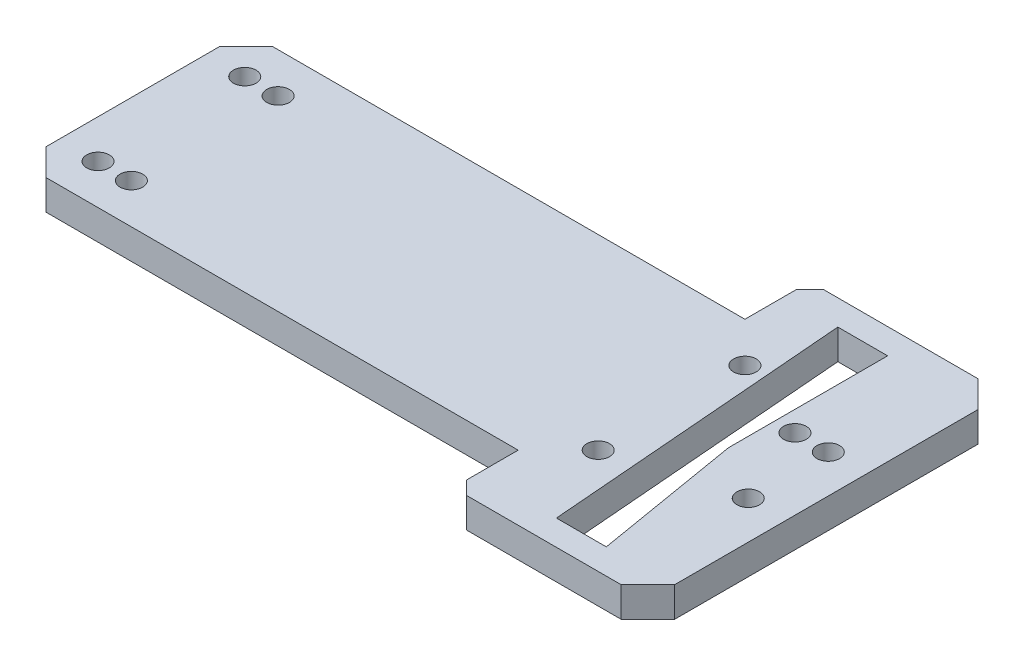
ISO-10303-21;
HEADER;
FILE_DESCRIPTION(('STEP AP214'),'2;1');
FILE_NAME('part.step','',(''),(''),'','','');
FILE_SCHEMA(('AUTOMOTIVE_DESIGN { 1 0 10303 214 1 1 1 1 }'));
ENDSEC;
DATA;
#1=APPLICATION_CONTEXT('core data for automotive mechanical design processes');
#2=APPLICATION_PROTOCOL_DEFINITION('international standard','automotive_design',2000,#1);
#3=PRODUCT_CONTEXT('',#1,'mechanical');
#4=PRODUCT('Part','Part','',(#3));
#5=PRODUCT_RELATED_PRODUCT_CATEGORY('part','',(#4));
#6=PRODUCT_DEFINITION_FORMATION('','',#4);
#7=PRODUCT_DEFINITION_CONTEXT('part definition',#1,'design');
#8=PRODUCT_DEFINITION('design','',#6,#7);
#9=PRODUCT_DEFINITION_SHAPE('','',#8);
#10=(LENGTH_UNIT() NAMED_UNIT(*) SI_UNIT(.MILLI.,.METRE.));
#11=(NAMED_UNIT(*) PLANE_ANGLE_UNIT() SI_UNIT($,.RADIAN.));
#12=(NAMED_UNIT(*) SI_UNIT($,.STERADIAN.) SOLID_ANGLE_UNIT());
#13=UNCERTAINTY_MEASURE_WITH_UNIT(LENGTH_MEASURE(1.E-05),#10,'distance_accuracy_value','');
#14=(GEOMETRIC_REPRESENTATION_CONTEXT(3) GLOBAL_UNCERTAINTY_ASSIGNED_CONTEXT((#13)) GLOBAL_UNIT_ASSIGNED_CONTEXT((#10,
#11,#12)) REPRESENTATION_CONTEXT('',''));
#15=CARTESIAN_POINT('',(0.,0.,0.));
#16=DIRECTION('',(0.,0.,1.));
#17=DIRECTION('',(1.,0.,0.));
#18=AXIS2_PLACEMENT_3D('',#15,#16,#17);
#19=CARTESIAN_POINT('',(0.,4.5,0.));
#20=DIRECTION('',(0.,1.,0.));
#21=DIRECTION('',(0.,0.,1.));
#22=AXIS2_PLACEMENT_3D('',#19,#20,#21);
#23=PLANE('',#22);
#24=CARTESIAN_POINT('',(51.3,4.5,-6.00000000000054));
#25=DIRECTION('',(0.,1.,0.));
#26=DIRECTION('',(0.,0.,1.));
#27=AXIS2_PLACEMENT_3D('',#24,#25,#26);
#28=CIRCLE('',#27,1.7);
#29=CARTESIAN_POINT('',(51.3,4.5,-4.30000000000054));
#30=VERTEX_POINT('',#29);
#31=EDGE_CURVE('E652',#30,#30,#28,.T.);
#32=ORIENTED_EDGE('',*,*,#31,.F.);
#33=EDGE_LOOP('',(#32));
#34=FACE_BOUND('',#33,.T.);
#35=CARTESIAN_POINT('',(33.8,4.5,10.9999999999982));
#36=DIRECTION('',(0.,1.,0.));
#37=DIRECTION('',(0.,0.,1.));
#38=AXIS2_PLACEMENT_3D('',#35,#36,#37);
#39=CIRCLE('',#38,1.7);
#40=CARTESIAN_POINT('',(33.8,4.5,12.6999999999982));
#41=VERTEX_POINT('',#40);
#42=EDGE_CURVE('E664',#41,#41,#39,.T.);
#43=ORIENTED_EDGE('',*,*,#42,.F.);
#44=EDGE_LOOP('',(#43));
#45=FACE_BOUND('',#44,.T.);
#46=CARTESIAN_POINT('',(-36.2,4.5,10.9999999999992));
#47=DIRECTION('',(0.,1.,0.));
#48=DIRECTION('',(0.,0.,1.));
#49=AXIS2_PLACEMENT_3D('',#46,#47,#48);
#50=CIRCLE('',#49,1.7);
#51=CARTESIAN_POINT('',(-36.2,4.5,12.6999999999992));
#52=VERTEX_POINT('',#51);
#53=EDGE_CURVE('E676',#52,#52,#50,.T.);
#54=ORIENTED_EDGE('',*,*,#53,.F.);
#55=EDGE_LOOP('',(#54));
#56=FACE_BOUND('',#55,.T.);
#57=CARTESIAN_POINT('',(-41.2,4.5,10.9999999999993));
#58=DIRECTION('',(0.,1.,0.));
#59=DIRECTION('',(0.,0.,1.));
#60=AXIS2_PLACEMENT_3D('',#57,#58,#59);
#61=CIRCLE('',#60,1.7);
#62=CARTESIAN_POINT('',(-41.2,4.5,12.6999999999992));
#63=VERTEX_POINT('',#62);
#64=EDGE_CURVE('E688',#63,#63,#61,.T.);
#65=ORIENTED_EDGE('',*,*,#64,.F.);
#66=EDGE_LOOP('',(#65));
#67=FACE_BOUND('',#66,.T.);
#68=DIRECTION('',(-0.166195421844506,0.,-0.986092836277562));
#69=VECTOR('',#68,1.);
#70=CARTESIAN_POINT('',(43.25,4.5,0.912138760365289));
#71=LINE('',#70,#69);
#72=CARTESIAN_POINT('',(46.9642462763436,4.5,22.9500000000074));
#73=VERTEX_POINT('',#72);
#74=CARTESIAN_POINT('',(43.25,4.5,0.912138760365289));
#75=VERTEX_POINT('',#74);
#76=EDGE_CURVE('E172',#73,#75,#71,.T.);
#77=ORIENTED_EDGE('',*,*,#76,.F.);
#78=DIRECTION('',(1.,0.,0.));
#79=VECTOR('',#78,1.);
#80=CARTESIAN_POINT('',(46.9642462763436,4.5,22.9500000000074));
#81=LINE('',#80,#79);
#82=CARTESIAN_POINT('',(39.4842462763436,4.5,22.9500000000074));
#83=VERTEX_POINT('',#82);
#84=EDGE_CURVE('E164',#83,#73,#81,.T.);
#85=ORIENTED_EDGE('',*,*,#84,.F.);
#86=DIRECTION('',(0.0803714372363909,0.,0.996764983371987));
#87=VECTOR('',#86,1.);
#88=CARTESIAN_POINT('',(39.4842462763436,4.5,22.9500000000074));
#89=LINE('',#88,#87);
#90=CARTESIAN_POINT('',(35.7832244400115,4.5,-22.95));
#91=VERTEX_POINT('',#90);
#92=EDGE_CURVE('E193',#91,#83,#89,.T.);
#93=ORIENTED_EDGE('',*,*,#92,.F.);
#94=DIRECTION('',(-1.,0.,0.));
#95=VECTOR('',#94,1.);
#96=CARTESIAN_POINT('',(35.7832244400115,4.5,-22.95));
#97=LINE('',#96,#95);
#98=CARTESIAN_POINT('',(43.25,4.5,-22.95));
#99=VERTEX_POINT('',#98);
#100=EDGE_CURVE('E188',#99,#91,#97,.T.);
#101=ORIENTED_EDGE('',*,*,#100,.F.);
#102=DIRECTION('',(0.,0.,-1.));
#103=VECTOR('',#102,1.);
#104=CARTESIAN_POINT('',(43.25,4.5,-22.95));
#105=LINE('',#104,#103);
#106=EDGE_CURVE('E186',#75,#99,#105,.T.);
#107=ORIENTED_EDGE('',*,*,#106,.F.);
#108=EDGE_LOOP('',(#77,#85,#93,#101,#107));
#109=FACE_BOUND('',#108,.T.);
#110=DIRECTION('',(0.,0.,1.));
#111=VECTOR('',#110,1.);
#112=CARTESIAN_POINT('',(27.8,4.5,-16.9999999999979));
#113=LINE('',#112,#111);
#114=CARTESIAN_POINT('',(27.8,4.5,-24.7500000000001));
#115=VERTEX_POINT('',#114);
#116=CARTESIAN_POINT('',(27.8,4.5,-16.9999999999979));
#117=VERTEX_POINT('',#116);
#118=EDGE_CURVE('E211',#115,#117,#113,.T.);
#119=ORIENTED_EDGE('',*,*,#118,.T.);
#120=DIRECTION('',(-1.,0.,0.));
#121=VECTOR('',#120,1.);
#122=CARTESIAN_POINT('',(-43.0000000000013,4.5,-16.9999999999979));
#123=LINE('',#122,#121);
#124=CARTESIAN_POINT('',(-43.0000000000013,4.5,-16.9999999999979));
#125=VERTEX_POINT('',#124);
#126=EDGE_CURVE('E214',#117,#125,#123,.T.);
#127=ORIENTED_EDGE('',*,*,#126,.T.);
#128=DIRECTION('',(-0.707106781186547,0.,0.707106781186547));
#129=VECTOR('',#128,1.);
#130=CARTESIAN_POINT('',(-47.000000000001,4.5,-12.9999999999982));
#131=LINE('',#130,#129);
#132=CARTESIAN_POINT('',(-47.000000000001,4.5,-12.9999999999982));
#133=VERTEX_POINT('',#132);
#134=EDGE_CURVE('E217',#125,#133,#131,.T.);
#135=ORIENTED_EDGE('',*,*,#134,.T.);
#136=DIRECTION('',(0.,0.,1.));
#137=VECTOR('',#136,1.);
#138=CARTESIAN_POINT('',(-47.000000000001,4.5,-12.9999999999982));
#139=LINE('',#138,#137);
#140=CARTESIAN_POINT('',(-47.000000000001,4.5,12.9999999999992));
#141=VERTEX_POINT('',#140);
#142=EDGE_CURVE('E219',#133,#141,#139,.T.);
#143=ORIENTED_EDGE('',*,*,#142,.T.);
#144=DIRECTION('',(0.707106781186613,0.,0.707106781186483));
#145=VECTOR('',#144,1.);
#146=CARTESIAN_POINT('',(-47.000000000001,4.5,12.9999999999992));
#147=LINE('',#146,#145);
#148=CARTESIAN_POINT('',(-43.0000000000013,4.5,16.9999999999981));
#149=VERTEX_POINT('',#148);
#150=EDGE_CURVE('E221',#141,#149,#147,.T.);
#151=ORIENTED_EDGE('',*,*,#150,.T.);
#152=DIRECTION('',(1.,0.,0.));
#153=VECTOR('',#152,1.);
#154=CARTESIAN_POINT('',(-43.0000000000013,4.5,16.9999999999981));
#155=LINE('',#154,#153);
#156=CARTESIAN_POINT('',(27.7999999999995,4.5,16.9999999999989));
#157=VERTEX_POINT('',#156);
#158=EDGE_CURVE('E223',#149,#157,#155,.T.);
#159=ORIENTED_EDGE('',*,*,#158,.T.);
#160=DIRECTION('',(0.,0.,1.));
#161=VECTOR('',#160,1.);
#162=CARTESIAN_POINT('',(27.7999999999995,4.5,16.9999999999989));
#163=LINE('',#162,#161);
#164=CARTESIAN_POINT('',(27.7999999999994,4.5,24.7499999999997));
#165=VERTEX_POINT('',#164);
#166=EDGE_CURVE('E225',#157,#165,#163,.T.);
#167=ORIENTED_EDGE('',*,*,#166,.T.);
#168=DIRECTION('',(0.707106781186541,0.,0.707106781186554));
#169=VECTOR('',#168,1.);
#170=CARTESIAN_POINT('',(27.7999999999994,4.5,24.7499999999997));
#171=LINE('',#170,#169);
#172=CARTESIAN_POINT('',(29.7999999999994,4.5,26.7499999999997));
#173=VERTEX_POINT('',#172);
#174=EDGE_CURVE('E227',#165,#173,#171,.T.);
#175=ORIENTED_EDGE('',*,*,#174,.T.);
#176=DIRECTION('',(1.,0.,0.));
#177=VECTOR('',#176,1.);
#178=CARTESIAN_POINT('',(52.9999999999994,4.5,26.7499999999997));
#179=LINE('',#178,#177);
#180=CARTESIAN_POINT('',(52.9999999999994,4.5,26.7499999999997));
#181=VERTEX_POINT('',#180);
#182=EDGE_CURVE('E229',#173,#181,#179,.T.);
#183=ORIENTED_EDGE('',*,*,#182,.T.);
#184=DIRECTION('',(0.707106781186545,0.,-0.70710678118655));
#185=VECTOR('',#184,1.);
#186=CARTESIAN_POINT('',(52.9999999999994,4.5,26.7499999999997));
#187=LINE('',#186,#185);
#188=CARTESIAN_POINT('',(56.9999999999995,4.5,22.7499999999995));
#189=VERTEX_POINT('',#188);
#190=EDGE_CURVE('E231',#181,#189,#187,.T.);
#191=ORIENTED_EDGE('',*,*,#190,.T.);
#192=DIRECTION('',(0.,0.,-1.));
#193=VECTOR('',#192,1.);
#194=CARTESIAN_POINT('',(56.9999999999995,4.5,22.7499999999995));
#195=LINE('',#194,#193);
#196=CARTESIAN_POINT('',(56.9999999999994,4.5,-22.7500000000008));
#197=VERTEX_POINT('',#196);
#198=EDGE_CURVE('E233',#189,#197,#195,.T.);
#199=ORIENTED_EDGE('',*,*,#198,.T.);
#200=DIRECTION('',(-0.707106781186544,0.,-0.707106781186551));
#201=VECTOR('',#200,1.);
#202=CARTESIAN_POINT('',(56.9999999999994,4.5,-22.7500000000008));
#203=LINE('',#202,#201);
#204=CARTESIAN_POINT('',(52.9999999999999,4.5,-26.7500000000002));
#205=VERTEX_POINT('',#204);
#206=EDGE_CURVE('E235',#197,#205,#203,.T.);
#207=ORIENTED_EDGE('',*,*,#206,.T.);
#208=DIRECTION('',(-1.,0.,0.));
#209=VECTOR('',#208,1.);
#210=CARTESIAN_POINT('',(52.9999999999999,4.5,-26.7500000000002));
#211=LINE('',#210,#209);
#212=CARTESIAN_POINT('',(29.8,4.5,-26.7500000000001));
#213=VERTEX_POINT('',#212);
#214=EDGE_CURVE('E237',#205,#213,#211,.T.);
#215=ORIENTED_EDGE('',*,*,#214,.T.);
#216=DIRECTION('',(-0.707106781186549,0.,0.707106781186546));
#217=VECTOR('',#216,1.);
#218=CARTESIAN_POINT('',(27.8,4.5,-24.7500000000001));
#219=LINE('',#218,#217);
#220=EDGE_CURVE('E239',#213,#115,#219,.T.);
#221=ORIENTED_EDGE('',*,*,#220,.T.);
#222=EDGE_LOOP('',(#119,#127,#135,#143,#151,#159,#167,#175,#183,#191,#199,#207,#215,#221));
#223=FACE_BOUND('',#222,.T.);
#224=CARTESIAN_POINT('',(-41.2,4.5,-10.9999999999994));
#225=DIRECTION('',(0.,1.,0.));
#226=DIRECTION('',(0.,0.,1.));
#227=AXIS2_PLACEMENT_3D('',#224,#225,#226);
#228=CIRCLE('',#227,1.7);
#229=CARTESIAN_POINT('',(-41.2,4.5,-9.29999999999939));
#230=VERTEX_POINT('',#229);
#231=EDGE_CURVE('E196',#230,#230,#228,.T.);
#232=ORIENTED_EDGE('',*,*,#231,.F.);
#233=EDGE_LOOP('',(#232));
#234=FACE_BOUND('',#233,.T.);
#235=CARTESIAN_POINT('',(-36.2,4.5,-10.9999999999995));
#236=DIRECTION('',(0.,1.,0.));
#237=DIRECTION('',(0.,0.,1.));
#238=AXIS2_PLACEMENT_3D('',#235,#236,#237);
#239=CIRCLE('',#238,1.7);
#240=CARTESIAN_POINT('',(-36.2,4.5,-9.29999999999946));
#241=VERTEX_POINT('',#240);
#242=EDGE_CURVE('E682',#241,#241,#239,.T.);
#243=ORIENTED_EDGE('',*,*,#242,.F.);
#244=EDGE_LOOP('',(#243));
#245=FACE_BOUND('',#244,.T.);
#246=CARTESIAN_POINT('',(33.8,4.5,-10.9999999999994));
#247=DIRECTION('',(0.,1.,0.));
#248=DIRECTION('',(0.,0.,1.));
#249=AXIS2_PLACEMENT_3D('',#246,#247,#248);
#250=CIRCLE('',#249,1.70000000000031);
#251=CARTESIAN_POINT('',(33.8,4.5,-9.29999999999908));
#252=VERTEX_POINT('',#251);
#253=EDGE_CURVE('E670',#252,#252,#250,.T.);
#254=ORIENTED_EDGE('',*,*,#253,.F.);
#255=EDGE_LOOP('',(#254));
#256=FACE_BOUND('',#255,.T.);
#257=CARTESIAN_POINT('',(46.3,4.5,-6.00000000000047));
#258=DIRECTION('',(0.,1.,0.));
#259=DIRECTION('',(0.,0.,1.));
#260=AXIS2_PLACEMENT_3D('',#257,#258,#259);
#261=CIRCLE('',#260,1.7);
#262=CARTESIAN_POINT('',(46.3,4.5,-4.30000000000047));
#263=VERTEX_POINT('',#262);
#264=EDGE_CURVE('E658',#263,#263,#261,.T.);
#265=ORIENTED_EDGE('',*,*,#264,.F.);
#266=EDGE_LOOP('',(#265));
#267=FACE_BOUND('',#266,.T.);
#268=CARTESIAN_POINT('',(51.3,4.5,5.99999999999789));
#269=DIRECTION('',(0.,1.,0.));
#270=DIRECTION('',(0.,0.,1.));
#271=AXIS2_PLACEMENT_3D('',#268,#269,#270);
#272=CIRCLE('',#271,1.7);
#273=CARTESIAN_POINT('',(51.3,4.5,7.69999999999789));
#274=VERTEX_POINT('',#273);
#275=EDGE_CURVE('E643',#274,#274,#272,.T.);
#276=ORIENTED_EDGE('',*,*,#275,.F.);
#277=EDGE_LOOP('',(#276));
#278=FACE_BOUND('',#277,.T.);
#279=ADVANCED_FACE('F33',(#34,#45,#56,#67,#109,#223,#234,#245,#256,#267,#278),#23,.T.);
#280=CARTESIAN_POINT('',(0.,0.,0.));
#281=DIRECTION('',(0.,1.,0.));
#282=DIRECTION('',(0.,0.,1.));
#283=AXIS2_PLACEMENT_3D('',#280,#281,#282);
#284=PLANE('',#283);
#285=CARTESIAN_POINT('',(51.3,0.,-6.00000000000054));
#286=DIRECTION('',(0.,1.,0.));
#287=DIRECTION('',(0.,0.,1.));
#288=AXIS2_PLACEMENT_3D('',#285,#286,#287);
#289=CIRCLE('',#288,1.7);
#290=CARTESIAN_POINT('',(51.3,0.,-4.30000000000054));
#291=VERTEX_POINT('',#290);
#292=EDGE_CURVE('E649',#291,#291,#289,.T.);
#293=ORIENTED_EDGE('',*,*,#292,.T.);
#294=EDGE_LOOP('',(#293));
#295=FACE_BOUND('',#294,.T.);
#296=CARTESIAN_POINT('',(33.8,0.,10.9999999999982));
#297=DIRECTION('',(0.,1.,0.));
#298=DIRECTION('',(0.,0.,1.));
#299=AXIS2_PLACEMENT_3D('',#296,#297,#298);
#300=CIRCLE('',#299,1.7);
#301=CARTESIAN_POINT('',(33.8,0.,12.6999999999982));
#302=VERTEX_POINT('',#301);
#303=EDGE_CURVE('E661',#302,#302,#300,.T.);
#304=ORIENTED_EDGE('',*,*,#303,.T.);
#305=EDGE_LOOP('',(#304));
#306=FACE_BOUND('',#305,.T.);
#307=CARTESIAN_POINT('',(-36.2,0.,10.9999999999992));
#308=DIRECTION('',(0.,1.,0.));
#309=DIRECTION('',(0.,0.,1.));
#310=AXIS2_PLACEMENT_3D('',#307,#308,#309);
#311=CIRCLE('',#310,1.7);
#312=CARTESIAN_POINT('',(-36.2,0.,12.6999999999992));
#313=VERTEX_POINT('',#312);
#314=EDGE_CURVE('E673',#313,#313,#311,.T.);
#315=ORIENTED_EDGE('',*,*,#314,.T.);
#316=EDGE_LOOP('',(#315));
#317=FACE_BOUND('',#316,.T.);
#318=CARTESIAN_POINT('',(-41.2,0.,10.9999999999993));
#319=DIRECTION('',(0.,1.,0.));
#320=DIRECTION('',(0.,0.,1.));
#321=AXIS2_PLACEMENT_3D('',#318,#319,#320);
#322=CIRCLE('',#321,1.7);
#323=CARTESIAN_POINT('',(-41.2,0.,12.6999999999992));
#324=VERTEX_POINT('',#323);
#325=EDGE_CURVE('E685',#324,#324,#322,.T.);
#326=ORIENTED_EDGE('',*,*,#325,.T.);
#327=EDGE_LOOP('',(#326));
#328=FACE_BOUND('',#327,.T.);
#329=DIRECTION('',(1.,0.,0.));
#330=VECTOR('',#329,1.);
#331=CARTESIAN_POINT('',(46.9642462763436,0.,22.9500000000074));
#332=LINE('',#331,#330);
#333=CARTESIAN_POINT('',(39.4842462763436,0.,22.9500000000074));
#334=VERTEX_POINT('',#333);
#335=CARTESIAN_POINT('',(46.9642462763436,0.,22.9500000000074));
#336=VERTEX_POINT('',#335);
#337=EDGE_CURVE('E56',#334,#336,#332,.T.);
#338=ORIENTED_EDGE('',*,*,#337,.T.);
#339=DIRECTION('',(-0.166195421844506,0.,-0.986092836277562));
#340=VECTOR('',#339,1.);
#341=CARTESIAN_POINT('',(43.25,0.,0.912138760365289));
#342=LINE('',#341,#340);
#343=CARTESIAN_POINT('',(43.25,0.,0.912138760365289));
#344=VERTEX_POINT('',#343);
#345=EDGE_CURVE('E179',#336,#344,#342,.T.);
#346=ORIENTED_EDGE('',*,*,#345,.T.);
#347=DIRECTION('',(0.,0.,-1.));
#348=VECTOR('',#347,1.);
#349=CARTESIAN_POINT('',(43.25,0.,-22.95));
#350=LINE('',#349,#348);
#351=CARTESIAN_POINT('',(43.25,0.,-22.95));
#352=VERTEX_POINT('',#351);
#353=EDGE_CURVE('E198',#344,#352,#350,.T.);
#354=ORIENTED_EDGE('',*,*,#353,.T.);
#355=DIRECTION('',(-1.,0.,0.));
#356=VECTOR('',#355,1.);
#357=CARTESIAN_POINT('',(35.7832244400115,0.,-22.95));
#358=LINE('',#357,#356);
#359=CARTESIAN_POINT('',(35.7832244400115,0.,-22.95));
#360=VERTEX_POINT('',#359);
#361=EDGE_CURVE('E201',#352,#360,#358,.T.);
#362=ORIENTED_EDGE('',*,*,#361,.T.);
#363=DIRECTION('',(0.0803714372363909,0.,0.996764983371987));
#364=VECTOR('',#363,1.);
#365=CARTESIAN_POINT('',(39.4842462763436,0.,22.9500000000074));
#366=LINE('',#365,#364);
#367=EDGE_CURVE('E173',#360,#334,#366,.T.);
#368=ORIENTED_EDGE('',*,*,#367,.T.);
#369=EDGE_LOOP('',(#338,#346,#354,#362,#368));
#370=FACE_BOUND('',#369,.T.);
#371=DIRECTION('',(0.,0.,1.));
#372=VECTOR('',#371,1.);
#373=CARTESIAN_POINT('',(27.8,0.,-16.9999999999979));
#374=LINE('',#373,#372);
#375=CARTESIAN_POINT('',(27.8,0.,-24.7500000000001));
#376=VERTEX_POINT('',#375);
#377=CARTESIAN_POINT('',(27.8,0.,-16.9999999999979));
#378=VERTEX_POINT('',#377);
#379=EDGE_CURVE('E180',#376,#378,#374,.T.);
#380=ORIENTED_EDGE('',*,*,#379,.F.);
#381=DIRECTION('',(-0.707106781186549,0.,0.707106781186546));
#382=VECTOR('',#381,1.);
#383=CARTESIAN_POINT('',(27.8,0.,-24.7500000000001));
#384=LINE('',#383,#382);
#385=CARTESIAN_POINT('',(29.8,0.,-26.7500000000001));
#386=VERTEX_POINT('',#385);
#387=EDGE_CURVE('E215',#386,#376,#384,.T.);
#388=ORIENTED_EDGE('',*,*,#387,.F.);
#389=DIRECTION('',(-1.,0.,0.));
#390=VECTOR('',#389,1.);
#391=CARTESIAN_POINT('',(52.9999999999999,0.,-26.7500000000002));
#392=LINE('',#391,#390);
#393=CARTESIAN_POINT('',(52.9999999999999,0.,-26.7500000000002));
#394=VERTEX_POINT('',#393);
#395=EDGE_CURVE('E266',#394,#386,#392,.T.);
#396=ORIENTED_EDGE('',*,*,#395,.F.);
#397=DIRECTION('',(-0.707106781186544,0.,-0.707106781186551));
#398=VECTOR('',#397,1.);
#399=CARTESIAN_POINT('',(56.9999999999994,0.,-22.7500000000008));
#400=LINE('',#399,#398);
#401=CARTESIAN_POINT('',(56.9999999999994,0.,-22.7500000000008));
#402=VERTEX_POINT('',#401);
#403=EDGE_CURVE('E264',#402,#394,#400,.T.);
#404=ORIENTED_EDGE('',*,*,#403,.F.);
#405=DIRECTION('',(0.,0.,-1.));
#406=VECTOR('',#405,1.);
#407=CARTESIAN_POINT('',(56.9999999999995,0.,22.7499999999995));
#408=LINE('',#407,#406);
#409=CARTESIAN_POINT('',(56.9999999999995,0.,22.7499999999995));
#410=VERTEX_POINT('',#409);
#411=EDGE_CURVE('E262',#410,#402,#408,.T.);
#412=ORIENTED_EDGE('',*,*,#411,.F.);
#413=DIRECTION('',(0.707106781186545,0.,-0.70710678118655));
#414=VECTOR('',#413,1.);
#415=CARTESIAN_POINT('',(52.9999999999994,0.,26.7499999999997));
#416=LINE('',#415,#414);
#417=CARTESIAN_POINT('',(52.9999999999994,0.,26.7499999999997));
#418=VERTEX_POINT('',#417);
#419=EDGE_CURVE('E260',#418,#410,#416,.T.);
#420=ORIENTED_EDGE('',*,*,#419,.F.);
#421=DIRECTION('',(1.,0.,0.));
#422=VECTOR('',#421,1.);
#423=CARTESIAN_POINT('',(52.9999999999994,0.,26.7499999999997));
#424=LINE('',#423,#422);
#425=CARTESIAN_POINT('',(29.7999999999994,0.,26.7499999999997));
#426=VERTEX_POINT('',#425);
#427=EDGE_CURVE('E258',#426,#418,#424,.T.);
#428=ORIENTED_EDGE('',*,*,#427,.F.);
#429=DIRECTION('',(0.707106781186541,0.,0.707106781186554));
#430=VECTOR('',#429,1.);
#431=CARTESIAN_POINT('',(27.7999999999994,0.,24.7499999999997));
#432=LINE('',#431,#430);
#433=CARTESIAN_POINT('',(27.7999999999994,0.,24.7499999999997));
#434=VERTEX_POINT('',#433);
#435=EDGE_CURVE('E256',#434,#426,#432,.T.);
#436=ORIENTED_EDGE('',*,*,#435,.F.);
#437=DIRECTION('',(0.,0.,1.));
#438=VECTOR('',#437,1.);
#439=CARTESIAN_POINT('',(27.7999999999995,0.,16.9999999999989));
#440=LINE('',#439,#438);
#441=CARTESIAN_POINT('',(27.7999999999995,0.,16.9999999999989));
#442=VERTEX_POINT('',#441);
#443=EDGE_CURVE('E254',#442,#434,#440,.T.);
#444=ORIENTED_EDGE('',*,*,#443,.F.);
#445=DIRECTION('',(1.,0.,0.));
#446=VECTOR('',#445,1.);
#447=CARTESIAN_POINT('',(-43.0000000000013,0.,16.9999999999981));
#448=LINE('',#447,#446);
#449=CARTESIAN_POINT('',(-43.0000000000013,0.,16.9999999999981));
#450=VERTEX_POINT('',#449);
#451=EDGE_CURVE('E252',#450,#442,#448,.T.);
#452=ORIENTED_EDGE('',*,*,#451,.F.);
#453=DIRECTION('',(0.707106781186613,0.,0.707106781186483));
#454=VECTOR('',#453,1.);
#455=CARTESIAN_POINT('',(-47.000000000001,0.,12.9999999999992));
#456=LINE('',#455,#454);
#457=CARTESIAN_POINT('',(-47.000000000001,0.,12.9999999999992));
#458=VERTEX_POINT('',#457);
#459=EDGE_CURVE('E250',#458,#450,#456,.T.);
#460=ORIENTED_EDGE('',*,*,#459,.F.);
#461=DIRECTION('',(0.,0.,1.));
#462=VECTOR('',#461,1.);
#463=CARTESIAN_POINT('',(-47.000000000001,0.,-12.9999999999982));
#464=LINE('',#463,#462);
#465=CARTESIAN_POINT('',(-47.000000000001,0.,-12.9999999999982));
#466=VERTEX_POINT('',#465);
#467=EDGE_CURVE('E248',#466,#458,#464,.T.);
#468=ORIENTED_EDGE('',*,*,#467,.F.);
#469=DIRECTION('',(-0.707106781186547,0.,0.707106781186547));
#470=VECTOR('',#469,1.);
#471=CARTESIAN_POINT('',(-47.000000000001,0.,-12.9999999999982));
#472=LINE('',#471,#470);
#473=CARTESIAN_POINT('',(-43.0000000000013,0.,-16.9999999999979));
#474=VERTEX_POINT('',#473);
#475=EDGE_CURVE('E246',#474,#466,#472,.T.);
#476=ORIENTED_EDGE('',*,*,#475,.F.);
#477=DIRECTION('',(-1.,0.,0.));
#478=VECTOR('',#477,1.);
#479=CARTESIAN_POINT('',(-43.0000000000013,0.,-16.9999999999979));
#480=LINE('',#479,#478);
#481=EDGE_CURVE('E244',#378,#474,#480,.T.);
#482=ORIENTED_EDGE('',*,*,#481,.F.);
#483=EDGE_LOOP('',(#380,#388,#396,#404,#412,#420,#428,#436,#444,#452,#460,#468,#476,#482));
#484=FACE_BOUND('',#483,.T.);
#485=CARTESIAN_POINT('',(-41.2,0.,-10.9999999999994));
#486=DIRECTION('',(0.,1.,0.));
#487=DIRECTION('',(0.,0.,1.));
#488=AXIS2_PLACEMENT_3D('',#485,#486,#487);
#489=CIRCLE('',#488,1.7);
#490=CARTESIAN_POINT('',(-41.2,0.,-9.29999999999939));
#491=VERTEX_POINT('',#490);
#492=EDGE_CURVE('E691',#491,#491,#489,.T.);
#493=ORIENTED_EDGE('',*,*,#492,.T.);
#494=EDGE_LOOP('',(#493));
#495=FACE_BOUND('',#494,.T.);
#496=CARTESIAN_POINT('',(-36.2,0.,-10.9999999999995));
#497=DIRECTION('',(0.,1.,0.));
#498=DIRECTION('',(0.,0.,1.));
#499=AXIS2_PLACEMENT_3D('',#496,#497,#498);
#500=CIRCLE('',#499,1.7);
#501=CARTESIAN_POINT('',(-36.2,0.,-9.29999999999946));
#502=VERTEX_POINT('',#501);
#503=EDGE_CURVE('E679',#502,#502,#500,.T.);
#504=ORIENTED_EDGE('',*,*,#503,.T.);
#505=EDGE_LOOP('',(#504));
#506=FACE_BOUND('',#505,.T.);
#507=CARTESIAN_POINT('',(33.8,0.,-10.9999999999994));
#508=DIRECTION('',(0.,1.,0.));
#509=DIRECTION('',(0.,0.,1.));
#510=AXIS2_PLACEMENT_3D('',#507,#508,#509);
#511=CIRCLE('',#510,1.70000000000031);
#512=CARTESIAN_POINT('',(33.8,0.,-9.29999999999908));
#513=VERTEX_POINT('',#512);
#514=EDGE_CURVE('E667',#513,#513,#511,.T.);
#515=ORIENTED_EDGE('',*,*,#514,.T.);
#516=EDGE_LOOP('',(#515));
#517=FACE_BOUND('',#516,.T.);
#518=CARTESIAN_POINT('',(46.3,0.,-6.00000000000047));
#519=DIRECTION('',(0.,1.,0.));
#520=DIRECTION('',(0.,0.,1.));
#521=AXIS2_PLACEMENT_3D('',#518,#519,#520);
#522=CIRCLE('',#521,1.7);
#523=CARTESIAN_POINT('',(46.3,0.,-4.30000000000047));
#524=VERTEX_POINT('',#523);
#525=EDGE_CURVE('E655',#524,#524,#522,.T.);
#526=ORIENTED_EDGE('',*,*,#525,.T.);
#527=EDGE_LOOP('',(#526));
#528=FACE_BOUND('',#527,.T.);
#529=CARTESIAN_POINT('',(51.3,0.,5.99999999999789));
#530=DIRECTION('',(0.,1.,0.));
#531=DIRECTION('',(0.,0.,1.));
#532=AXIS2_PLACEMENT_3D('',#529,#530,#531);
#533=CIRCLE('',#532,1.7);
#534=CARTESIAN_POINT('',(51.3,0.,7.69999999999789));
#535=VERTEX_POINT('',#534);
#536=EDGE_CURVE('E646',#535,#535,#533,.T.);
#537=ORIENTED_EDGE('',*,*,#536,.T.);
#538=EDGE_LOOP('',(#537));
#539=FACE_BOUND('',#538,.T.);
#540=ADVANCED_FACE('F314',(#295,#306,#317,#328,#370,#484,#495,#506,#517,#528,#539),#284,.F.);
#541=CARTESIAN_POINT('',(27.8,4.5,-16.9999999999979));
#542=DIRECTION('',(1.,0.,0.));
#543=DIRECTION('',(0.,0.,-1.));
#544=AXIS2_PLACEMENT_3D('',#541,#542,#543);
#545=PLANE('',#544);
#546=ORIENTED_EDGE('',*,*,#379,.T.);
#547=DIRECTION('',(0.,-1.,0.));
#548=VECTOR('',#547,1.);
#549=CARTESIAN_POINT('',(27.8,4.5,-16.9999999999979));
#550=LINE('',#549,#548);
#551=EDGE_CURVE('E11',#117,#378,#550,.T.);
#552=ORIENTED_EDGE('',*,*,#551,.F.);
#553=ORIENTED_EDGE('',*,*,#118,.F.);
#554=DIRECTION('',(0.,-1.,0.));
#555=VECTOR('',#554,1.);
#556=CARTESIAN_POINT('',(27.8,4.5,-24.7500000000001));
#557=LINE('',#556,#555);
#558=EDGE_CURVE('E241',#115,#376,#557,.T.);
#559=ORIENTED_EDGE('',*,*,#558,.T.);
#560=EDGE_LOOP('',(#546,#552,#553,#559));
#561=FACE_BOUND('',#560,.T.);
#562=ADVANCED_FACE('F35',(#561),#545,.F.);
#563=CARTESIAN_POINT('',(-43.0000000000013,4.5,-16.9999999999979));
#564=DIRECTION('',(0.,0.,1.));
#565=DIRECTION('',(1.,0.,0.));
#566=AXIS2_PLACEMENT_3D('',#563,#564,#565);
#567=PLANE('',#566);
#568=ORIENTED_EDGE('',*,*,#481,.T.);
#569=DIRECTION('',(0.,-1.,0.));
#570=VECTOR('',#569,1.);
#571=CARTESIAN_POINT('',(-43.0000000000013,4.5,-16.9999999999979));
#572=LINE('',#571,#570);
#573=EDGE_CURVE('E41',#125,#474,#572,.T.);
#574=ORIENTED_EDGE('',*,*,#573,.F.);
#575=ORIENTED_EDGE('',*,*,#126,.F.);
#576=ORIENTED_EDGE('',*,*,#551,.T.);
#577=EDGE_LOOP('',(#568,#574,#575,#576));
#578=FACE_BOUND('',#577,.T.);
#579=ADVANCED_FACE('F331',(#578),#567,.F.);
#580=CARTESIAN_POINT('',(-47.000000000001,4.5,-12.9999999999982));
#581=DIRECTION('',(0.707106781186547,0.,0.707106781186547));
#582=DIRECTION('',(0.707106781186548,0.,-0.707106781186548));
#583=AXIS2_PLACEMENT_3D('',#580,#581,#582);
#584=PLANE('',#583);
#585=ORIENTED_EDGE('',*,*,#475,.T.);
#586=DIRECTION('',(0.,-1.,0.));
#587=VECTOR('',#586,1.);
#588=CARTESIAN_POINT('',(-47.000000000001,4.5,-12.9999999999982));
#589=LINE('',#588,#587);
#590=EDGE_CURVE('E301',#133,#466,#589,.T.);
#591=ORIENTED_EDGE('',*,*,#590,.F.);
#592=ORIENTED_EDGE('',*,*,#134,.F.);
#593=ORIENTED_EDGE('',*,*,#573,.T.);
#594=EDGE_LOOP('',(#585,#591,#592,#593));
#595=FACE_BOUND('',#594,.T.);
#596=ADVANCED_FACE('F308',(#595),#584,.F.);
#597=CARTESIAN_POINT('',(-47.000000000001,4.5,-12.9999999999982));
#598=DIRECTION('',(1.,0.,0.));
#599=DIRECTION('',(0.,0.,-1.));
#600=AXIS2_PLACEMENT_3D('',#597,#598,#599);
#601=PLANE('',#600);
#602=ORIENTED_EDGE('',*,*,#467,.T.);
#603=DIRECTION('',(0.,-1.,0.));
#604=VECTOR('',#603,1.);
#605=CARTESIAN_POINT('',(-47.000000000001,4.5,12.9999999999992));
#606=LINE('',#605,#604);
#607=EDGE_CURVE('E298',#141,#458,#606,.T.);
#608=ORIENTED_EDGE('',*,*,#607,.F.);
#609=ORIENTED_EDGE('',*,*,#142,.F.);
#610=ORIENTED_EDGE('',*,*,#590,.T.);
#611=EDGE_LOOP('',(#602,#608,#609,#610));
#612=FACE_BOUND('',#611,.T.);
#613=ADVANCED_FACE('F320',(#612),#601,.F.);
#614=CARTESIAN_POINT('',(-47.000000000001,4.5,12.9999999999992));
#615=DIRECTION('',(0.707106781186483,0.,-0.707106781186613));
#616=DIRECTION('',(-0.707106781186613,0.,-0.707106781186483));
#617=AXIS2_PLACEMENT_3D('',#614,#615,#616);
#618=PLANE('',#617);
#619=ORIENTED_EDGE('',*,*,#459,.T.);
#620=DIRECTION('',(0.,-1.,0.));
#621=VECTOR('',#620,1.);
#622=CARTESIAN_POINT('',(-43.0000000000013,4.5,16.9999999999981));
#623=LINE('',#622,#621);
#624=EDGE_CURVE('E295',#149,#450,#623,.T.);
#625=ORIENTED_EDGE('',*,*,#624,.F.);
#626=ORIENTED_EDGE('',*,*,#150,.F.);
#627=ORIENTED_EDGE('',*,*,#607,.T.);
#628=EDGE_LOOP('',(#619,#625,#626,#627));
#629=FACE_BOUND('',#628,.T.);
#630=ADVANCED_FACE('F324',(#629),#618,.F.);
#631=CARTESIAN_POINT('',(-43.0000000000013,4.5,16.9999999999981));
#632=DIRECTION('',(0.,0.,-1.));
#633=DIRECTION('',(-1.,0.,0.));
#634=AXIS2_PLACEMENT_3D('',#631,#632,#633);
#635=PLANE('',#634);
#636=ORIENTED_EDGE('',*,*,#451,.T.);
#637=DIRECTION('',(0.,-1.,0.));
#638=VECTOR('',#637,1.);
#639=CARTESIAN_POINT('',(27.7999999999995,4.5,16.9999999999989));
#640=LINE('',#639,#638);
#641=EDGE_CURVE('E292',#157,#442,#640,.T.);
#642=ORIENTED_EDGE('',*,*,#641,.F.);
#643=ORIENTED_EDGE('',*,*,#158,.F.);
#644=ORIENTED_EDGE('',*,*,#624,.T.);
#645=EDGE_LOOP('',(#636,#642,#643,#644));
#646=FACE_BOUND('',#645,.T.);
#647=ADVANCED_FACE('F374',(#646),#635,.F.);
#648=CARTESIAN_POINT('',(27.7999999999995,4.5,16.9999999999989));
#649=DIRECTION('',(1.,0.,0.));
#650=DIRECTION('',(0.,0.,-1.));
#651=AXIS2_PLACEMENT_3D('',#648,#649,#650);
#652=PLANE('',#651);
#653=ORIENTED_EDGE('',*,*,#443,.T.);
#654=DIRECTION('',(0.,-1.,0.));
#655=VECTOR('',#654,1.);
#656=CARTESIAN_POINT('',(27.7999999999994,4.5,24.7499999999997));
#657=LINE('',#656,#655);
#658=EDGE_CURVE('E289',#165,#434,#657,.T.);
#659=ORIENTED_EDGE('',*,*,#658,.F.);
#660=ORIENTED_EDGE('',*,*,#166,.F.);
#661=ORIENTED_EDGE('',*,*,#641,.T.);
#662=EDGE_LOOP('',(#653,#659,#660,#661));
#663=FACE_BOUND('',#662,.T.);
#664=ADVANCED_FACE('F372',(#663),#652,.F.);
#665=CARTESIAN_POINT('',(27.7999999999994,4.5,24.7499999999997));
#666=DIRECTION('',(0.707106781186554,0.,-0.707106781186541));
#667=DIRECTION('',(-0.707106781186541,0.,-0.707106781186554));
#668=AXIS2_PLACEMENT_3D('',#665,#666,#667);
#669=PLANE('',#668);
#670=ORIENTED_EDGE('',*,*,#435,.T.);
#671=DIRECTION('',(0.,-1.,0.));
#672=VECTOR('',#671,1.);
#673=CARTESIAN_POINT('',(29.7999999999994,4.5,26.7499999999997));
#674=LINE('',#673,#672);
#675=EDGE_CURVE('E286',#173,#426,#674,.T.);
#676=ORIENTED_EDGE('',*,*,#675,.F.);
#677=ORIENTED_EDGE('',*,*,#174,.F.);
#678=ORIENTED_EDGE('',*,*,#658,.T.);
#679=EDGE_LOOP('',(#670,#676,#677,#678));
#680=FACE_BOUND('',#679,.T.);
#681=ADVANCED_FACE('F367',(#680),#669,.F.);
#682=CARTESIAN_POINT('',(52.9999999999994,4.5,26.7499999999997));
#683=DIRECTION('',(0.,0.,-1.));
#684=DIRECTION('',(-1.,0.,0.));
#685=AXIS2_PLACEMENT_3D('',#682,#683,#684);
#686=PLANE('',#685);
#687=ORIENTED_EDGE('',*,*,#427,.T.);
#688=DIRECTION('',(0.,-1.,0.));
#689=VECTOR('',#688,1.);
#690=CARTESIAN_POINT('',(52.9999999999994,4.5,26.7499999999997));
#691=LINE('',#690,#689);
#692=EDGE_CURVE('E283',#181,#418,#691,.T.);
#693=ORIENTED_EDGE('',*,*,#692,.F.);
#694=ORIENTED_EDGE('',*,*,#182,.F.);
#695=ORIENTED_EDGE('',*,*,#675,.T.);
#696=EDGE_LOOP('',(#687,#693,#694,#695));
#697=FACE_BOUND('',#696,.T.);
#698=ADVANCED_FACE('F362',(#697),#686,.F.);
#699=CARTESIAN_POINT('',(52.9999999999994,4.5,26.7499999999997));
#700=DIRECTION('',(-0.70710678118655,0.,-0.707106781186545));
#701=DIRECTION('',(-0.707106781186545,0.,0.70710678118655));
#702=AXIS2_PLACEMENT_3D('',#699,#700,#701);
#703=PLANE('',#702);
#704=ORIENTED_EDGE('',*,*,#419,.T.);
#705=DIRECTION('',(0.,-1.,0.));
#706=VECTOR('',#705,1.);
#707=CARTESIAN_POINT('',(56.9999999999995,4.5,22.7499999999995));
#708=LINE('',#707,#706);
#709=EDGE_CURVE('E280',#189,#410,#708,.T.);
#710=ORIENTED_EDGE('',*,*,#709,.F.);
#711=ORIENTED_EDGE('',*,*,#190,.F.);
#712=ORIENTED_EDGE('',*,*,#692,.T.);
#713=EDGE_LOOP('',(#704,#710,#711,#712));
#714=FACE_BOUND('',#713,.T.);
#715=ADVANCED_FACE('F358',(#714),#703,.F.);
#716=CARTESIAN_POINT('',(56.9999999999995,4.5,22.7499999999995));
#717=DIRECTION('',(-1.,0.,0.));
#718=DIRECTION('',(0.,0.,1.));
#719=AXIS2_PLACEMENT_3D('',#716,#717,#718);
#720=PLANE('',#719);
#721=ORIENTED_EDGE('',*,*,#411,.T.);
#722=DIRECTION('',(0.,-1.,0.));
#723=VECTOR('',#722,1.);
#724=CARTESIAN_POINT('',(56.9999999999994,4.5,-22.7500000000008));
#725=LINE('',#724,#723);
#726=EDGE_CURVE('E277',#197,#402,#725,.T.);
#727=ORIENTED_EDGE('',*,*,#726,.F.);
#728=ORIENTED_EDGE('',*,*,#198,.F.);
#729=ORIENTED_EDGE('',*,*,#709,.T.);
#730=EDGE_LOOP('',(#721,#727,#728,#729));
#731=FACE_BOUND('',#730,.T.);
#732=ADVANCED_FACE('F353',(#731),#720,.F.);
#733=CARTESIAN_POINT('',(56.9999999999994,4.5,-22.7500000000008));
#734=DIRECTION('',(-0.707106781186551,0.,0.707106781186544));
#735=DIRECTION('',(0.707106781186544,0.,0.707106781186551));
#736=AXIS2_PLACEMENT_3D('',#733,#734,#735);
#737=PLANE('',#736);
#738=ORIENTED_EDGE('',*,*,#403,.T.);
#739=DIRECTION('',(0.,-1.,0.));
#740=VECTOR('',#739,1.);
#741=CARTESIAN_POINT('',(52.9999999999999,4.5,-26.7500000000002));
#742=LINE('',#741,#740);
#743=EDGE_CURVE('E274',#205,#394,#742,.T.);
#744=ORIENTED_EDGE('',*,*,#743,.F.);
#745=ORIENTED_EDGE('',*,*,#206,.F.);
#746=ORIENTED_EDGE('',*,*,#726,.T.);
#747=EDGE_LOOP('',(#738,#744,#745,#746));
#748=FACE_BOUND('',#747,.T.);
#749=ADVANCED_FACE('F347',(#748),#737,.F.);
#750=CARTESIAN_POINT('',(52.9999999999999,4.5,-26.7500000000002));
#751=DIRECTION('',(0.,0.,1.));
#752=DIRECTION('',(1.,0.,0.));
#753=AXIS2_PLACEMENT_3D('',#750,#751,#752);
#754=PLANE('',#753);
#755=ORIENTED_EDGE('',*,*,#395,.T.);
#756=DIRECTION('',(0.,-1.,0.));
#757=VECTOR('',#756,1.);
#758=CARTESIAN_POINT('',(29.8,4.5,-26.7500000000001));
#759=LINE('',#758,#757);
#760=EDGE_CURVE('E271',#213,#386,#759,.T.);
#761=ORIENTED_EDGE('',*,*,#760,.F.);
#762=ORIENTED_EDGE('',*,*,#214,.F.);
#763=ORIENTED_EDGE('',*,*,#743,.T.);
#764=EDGE_LOOP('',(#755,#761,#762,#763));
#765=FACE_BOUND('',#764,.T.);
#766=ADVANCED_FACE('F343',(#765),#754,.F.);
#767=CARTESIAN_POINT('',(27.8,4.5,-24.7500000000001));
#768=DIRECTION('',(0.707106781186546,0.,0.707106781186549));
#769=DIRECTION('',(0.707106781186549,0.,-0.707106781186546));
#770=AXIS2_PLACEMENT_3D('',#767,#768,#769);
#771=PLANE('',#770);
#772=ORIENTED_EDGE('',*,*,#387,.T.);
#773=ORIENTED_EDGE('',*,*,#558,.F.);
#774=ORIENTED_EDGE('',*,*,#220,.F.);
#775=ORIENTED_EDGE('',*,*,#760,.T.);
#776=EDGE_LOOP('',(#772,#773,#774,#775));
#777=FACE_BOUND('',#776,.T.);
#778=ADVANCED_FACE('F338',(#777),#771,.F.);
#779=CARTESIAN_POINT('',(46.9642462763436,4.5,22.9500000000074));
#780=DIRECTION('',(0.,0.,-1.));
#781=DIRECTION('',(-1.,0.,0.));
#782=AXIS2_PLACEMENT_3D('',#779,#780,#781);
#783=PLANE('',#782);
#784=ORIENTED_EDGE('',*,*,#337,.F.);
#785=DIRECTION('',(0.,-1.,0.));
#786=VECTOR('',#785,1.);
#787=CARTESIAN_POINT('',(39.4842462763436,4.5,22.9500000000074));
#788=LINE('',#787,#786);
#789=EDGE_CURVE('E168',#83,#334,#788,.T.);
#790=ORIENTED_EDGE('',*,*,#789,.F.);
#791=ORIENTED_EDGE('',*,*,#84,.T.);
#792=DIRECTION('',(0.,-1.,0.));
#793=VECTOR('',#792,1.);
#794=CARTESIAN_POINT('',(46.9642462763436,4.5,22.9500000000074));
#795=LINE('',#794,#793);
#796=EDGE_CURVE('E167',#73,#336,#795,.T.);
#797=ORIENTED_EDGE('',*,*,#796,.T.);
#798=EDGE_LOOP('',(#784,#790,#791,#797));
#799=FACE_BOUND('',#798,.T.);
#800=ADVANCED_FACE('F166',(#799),#783,.T.);
#801=CARTESIAN_POINT('',(43.25,4.5,0.912138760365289));
#802=DIRECTION('',(-0.986092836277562,0.,0.166195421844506));
#803=DIRECTION('',(0.166195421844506,0.,0.986092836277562));
#804=AXIS2_PLACEMENT_3D('',#801,#802,#803);
#805=PLANE('',#804);
#806=ORIENTED_EDGE('',*,*,#345,.F.);
#807=ORIENTED_EDGE('',*,*,#796,.F.);
#808=ORIENTED_EDGE('',*,*,#76,.T.);
#809=DIRECTION('',(0.,-1.,0.));
#810=VECTOR('',#809,1.);
#811=CARTESIAN_POINT('',(43.25,4.5,0.912138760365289));
#812=LINE('',#811,#810);
#813=EDGE_CURVE('E181',#75,#344,#812,.T.);
#814=ORIENTED_EDGE('',*,*,#813,.T.);
#815=EDGE_LOOP('',(#806,#807,#808,#814));
#816=FACE_BOUND('',#815,.T.);
#817=ADVANCED_FACE('F176',(#816),#805,.T.);
#818=CARTESIAN_POINT('',(43.25,4.5,-22.95));
#819=DIRECTION('',(-1.,0.,0.));
#820=DIRECTION('',(0.,0.,1.));
#821=AXIS2_PLACEMENT_3D('',#818,#819,#820);
#822=PLANE('',#821);
#823=ORIENTED_EDGE('',*,*,#353,.F.);
#824=ORIENTED_EDGE('',*,*,#813,.F.);
#825=ORIENTED_EDGE('',*,*,#106,.T.);
#826=DIRECTION('',(0.,-1.,0.));
#827=VECTOR('',#826,1.);
#828=CARTESIAN_POINT('',(43.25,4.5,-22.95));
#829=LINE('',#828,#827);
#830=EDGE_CURVE('E208',#99,#352,#829,.T.);
#831=ORIENTED_EDGE('',*,*,#830,.T.);
#832=EDGE_LOOP('',(#823,#824,#825,#831));
#833=FACE_BOUND('',#832,.T.);
#834=ADVANCED_FACE('F448',(#833),#822,.T.);
#835=CARTESIAN_POINT('',(35.7832244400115,4.5,-22.95));
#836=DIRECTION('',(0.,0.,1.));
#837=DIRECTION('',(1.,0.,0.));
#838=AXIS2_PLACEMENT_3D('',#835,#836,#837);
#839=PLANE('',#838);
#840=ORIENTED_EDGE('',*,*,#361,.F.);
#841=ORIENTED_EDGE('',*,*,#830,.F.);
#842=ORIENTED_EDGE('',*,*,#100,.T.);
#843=DIRECTION('',(0.,-1.,0.));
#844=VECTOR('',#843,1.);
#845=CARTESIAN_POINT('',(35.7832244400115,4.5,-22.95));
#846=LINE('',#845,#844);
#847=EDGE_CURVE('E48',#91,#360,#846,.T.);
#848=ORIENTED_EDGE('',*,*,#847,.T.);
#849=EDGE_LOOP('',(#840,#841,#842,#848));
#850=FACE_BOUND('',#849,.T.);
#851=ADVANCED_FACE('F454',(#850),#839,.T.);
#852=CARTESIAN_POINT('',(39.4842462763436,4.5,22.9500000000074));
#853=DIRECTION('',(0.996764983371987,0.,-0.0803714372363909));
#854=DIRECTION('',(-0.0803714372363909,0.,-0.996764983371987));
#855=AXIS2_PLACEMENT_3D('',#852,#853,#854);
#856=PLANE('',#855);
#857=ORIENTED_EDGE('',*,*,#367,.F.);
#858=ORIENTED_EDGE('',*,*,#847,.F.);
#859=ORIENTED_EDGE('',*,*,#92,.T.);
#860=ORIENTED_EDGE('',*,*,#789,.T.);
#861=EDGE_LOOP('',(#857,#858,#859,#860));
#862=FACE_BOUND('',#861,.T.);
#863=ADVANCED_FACE('F462',(#862),#856,.T.);
#864=CARTESIAN_POINT('',(-41.2,4.5,-10.9999999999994));
#865=DIRECTION('',(0.,-1.,0.));
#866=DIRECTION('',(0.,0.,-1.));
#867=AXIS2_PLACEMENT_3D('',#864,#865,#866);
#868=CYLINDRICAL_SURFACE('',#867,1.7);
#869=ORIENTED_EDGE('',*,*,#231,.T.);
#870=EDGE_LOOP('',(#869));
#871=FACE_BOUND('',#870,.T.);
#872=ORIENTED_EDGE('',*,*,#492,.F.);
#873=EDGE_LOOP('',(#872));
#874=FACE_BOUND('',#873,.T.);
#875=ADVANCED_FACE('F470',(#871,#874),#868,.F.);
#876=CARTESIAN_POINT('',(-41.2,4.5,10.9999999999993));
#877=DIRECTION('',(0.,-1.,0.));
#878=DIRECTION('',(0.,0.,-1.));
#879=AXIS2_PLACEMENT_3D('',#876,#877,#878);
#880=CYLINDRICAL_SURFACE('',#879,1.7);
#881=ORIENTED_EDGE('',*,*,#64,.T.);
#882=EDGE_LOOP('',(#881));
#883=FACE_BOUND('',#882,.T.);
#884=ORIENTED_EDGE('',*,*,#325,.F.);
#885=EDGE_LOOP('',(#884));
#886=FACE_BOUND('',#885,.T.);
#887=ADVANCED_FACE('F477',(#883,#886),#880,.F.);
#888=CARTESIAN_POINT('',(-36.2,4.5,-10.9999999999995));
#889=DIRECTION('',(0.,-1.,0.));
#890=DIRECTION('',(0.,0.,-1.));
#891=AXIS2_PLACEMENT_3D('',#888,#889,#890);
#892=CYLINDRICAL_SURFACE('',#891,1.7);
#893=ORIENTED_EDGE('',*,*,#242,.T.);
#894=EDGE_LOOP('',(#893));
#895=FACE_BOUND('',#894,.T.);
#896=ORIENTED_EDGE('',*,*,#503,.F.);
#897=EDGE_LOOP('',(#896));
#898=FACE_BOUND('',#897,.T.);
#899=ADVANCED_FACE('F485',(#895,#898),#892,.F.);
#900=CARTESIAN_POINT('',(-36.2,4.5,10.9999999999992));
#901=DIRECTION('',(0.,-1.,0.));
#902=DIRECTION('',(0.,0.,-1.));
#903=AXIS2_PLACEMENT_3D('',#900,#901,#902);
#904=CYLINDRICAL_SURFACE('',#903,1.7);
#905=ORIENTED_EDGE('',*,*,#53,.T.);
#906=EDGE_LOOP('',(#905));
#907=FACE_BOUND('',#906,.T.);
#908=ORIENTED_EDGE('',*,*,#314,.F.);
#909=EDGE_LOOP('',(#908));
#910=FACE_BOUND('',#909,.T.);
#911=ADVANCED_FACE('F493',(#907,#910),#904,.F.);
#912=CARTESIAN_POINT('',(33.8,4.5,-10.9999999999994));
#913=DIRECTION('',(0.,-1.,0.));
#914=DIRECTION('',(0.,0.,-1.));
#915=AXIS2_PLACEMENT_3D('',#912,#913,#914);
#916=CYLINDRICAL_SURFACE('',#915,1.70000000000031);
#917=ORIENTED_EDGE('',*,*,#253,.T.);
#918=EDGE_LOOP('',(#917));
#919=FACE_BOUND('',#918,.T.);
#920=ORIENTED_EDGE('',*,*,#514,.F.);
#921=EDGE_LOOP('',(#920));
#922=FACE_BOUND('',#921,.T.);
#923=ADVANCED_FACE('F501',(#919,#922),#916,.F.);
#924=CARTESIAN_POINT('',(33.8,4.5,10.9999999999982));
#925=DIRECTION('',(0.,-1.,0.));
#926=DIRECTION('',(0.,0.,-1.));
#927=AXIS2_PLACEMENT_3D('',#924,#925,#926);
#928=CYLINDRICAL_SURFACE('',#927,1.7);
#929=ORIENTED_EDGE('',*,*,#42,.T.);
#930=EDGE_LOOP('',(#929));
#931=FACE_BOUND('',#930,.T.);
#932=ORIENTED_EDGE('',*,*,#303,.F.);
#933=EDGE_LOOP('',(#932));
#934=FACE_BOUND('',#933,.T.);
#935=ADVANCED_FACE('F509',(#931,#934),#928,.F.);
#936=CARTESIAN_POINT('',(46.3,4.5,-6.00000000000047));
#937=DIRECTION('',(0.,-1.,0.));
#938=DIRECTION('',(0.,0.,-1.));
#939=AXIS2_PLACEMENT_3D('',#936,#937,#938);
#940=CYLINDRICAL_SURFACE('',#939,1.7);
#941=ORIENTED_EDGE('',*,*,#264,.T.);
#942=EDGE_LOOP('',(#941));
#943=FACE_BOUND('',#942,.T.);
#944=ORIENTED_EDGE('',*,*,#525,.F.);
#945=EDGE_LOOP('',(#944));
#946=FACE_BOUND('',#945,.T.);
#947=ADVANCED_FACE('F517',(#943,#946),#940,.F.);
#948=CARTESIAN_POINT('',(51.3,4.5,-6.00000000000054));
#949=DIRECTION('',(0.,-1.,0.));
#950=DIRECTION('',(0.,0.,-1.));
#951=AXIS2_PLACEMENT_3D('',#948,#949,#950);
#952=CYLINDRICAL_SURFACE('',#951,1.7);
#953=ORIENTED_EDGE('',*,*,#31,.T.);
#954=EDGE_LOOP('',(#953));
#955=FACE_BOUND('',#954,.T.);
#956=ORIENTED_EDGE('',*,*,#292,.F.);
#957=EDGE_LOOP('',(#956));
#958=FACE_BOUND('',#957,.T.);
#959=ADVANCED_FACE('F525',(#955,#958),#952,.F.);
#960=CARTESIAN_POINT('',(51.3,4.5,5.99999999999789));
#961=DIRECTION('',(0.,-1.,0.));
#962=DIRECTION('',(0.,0.,-1.));
#963=AXIS2_PLACEMENT_3D('',#960,#961,#962);
#964=CYLINDRICAL_SURFACE('',#963,1.7);
#965=ORIENTED_EDGE('',*,*,#275,.T.);
#966=EDGE_LOOP('',(#965));
#967=FACE_BOUND('',#966,.T.);
#968=ORIENTED_EDGE('',*,*,#536,.F.);
#969=EDGE_LOOP('',(#968));
#970=FACE_BOUND('',#969,.T.);
#971=ADVANCED_FACE('F533',(#967,#970),#964,.F.);
#972=CLOSED_SHELL('',(#279,#540,#562,#579,#596,#613,#630,#647,#664,#681,#698,#715,#732,#749,
#766,#778,#800,#817,#834,#851,#863,#875,#887,#899,#911,#923,#935,#947,#959,#971));
#973=MANIFOLD_SOLID_BREP('B2',#972);
#974=ADVANCED_BREP_SHAPE_REPRESENTATION('',(#18,#973),#14);
#975=SHAPE_DEFINITION_REPRESENTATION(#9,#974);
ENDSEC;
END-ISO-10303-21;
